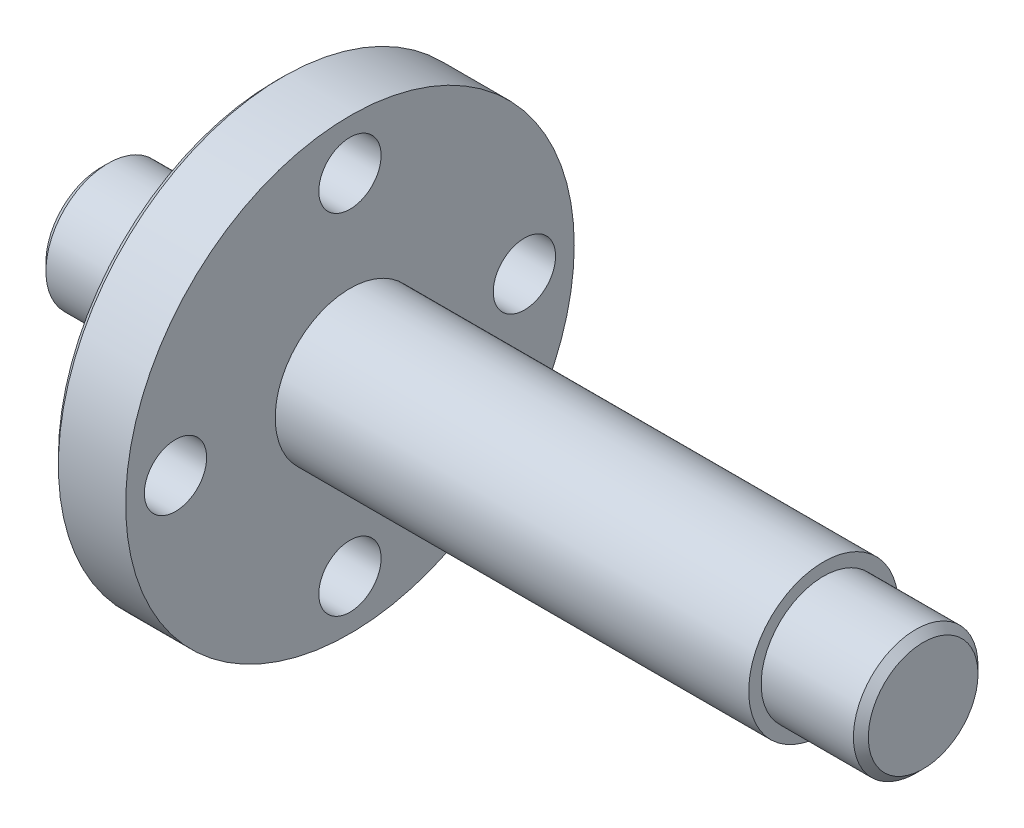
from build123d import *

# Parameters (mm, degrees)
SKETCH_1_R               = 2
EXTRUDE_1_DEPTH          = 15
SKETCH_2_R               = 2.5
EXTRUDE_2_DEPTH          = 4
SKETCH_3_R               = 3
EXTRUDE_3_DEPTH          = 3
SKETCH_4_R               = 9
EXTRUDE_4_DEPTH          = 3
SKETCH_5_R               = 3
EXTRUDE_5_DEPTH          = 19
SKETCH_8_R               = 2.5
EXTRUDE_6_DEPTH          = 4
HOLE_WIZARD_M3_2_D       = 2.5
PATTERN_CIRCULAR_2_COUNT = 4
CHAMFER_1_SIZE           = 0.3
SKETCH_11_W              = 15
SKETCH_11_H              = 4
CUT_EXTRUDE_1_DEPTH      = 5
SKETCH_19_R              = 1.5
CUT_EXTRUDE_3_DEPTH      = 10
CHAMFER_2_SIZE           = 0.3


with BuildPart() as part:
    # Sketch 1 → Extrude 1 (new body)
    with BuildSketch(Plane(origin=(0, 0, 0), x_dir=(0, 0, -1), z_dir=(1, 0, 0))):
        Circle(SKETCH_1_R)
    extrude(amount=EXTRUDE_1_DEPTH)

    # Sketch 2 → Extrude 2 (add)
    with BuildSketch(Plane(origin=(15, 0, 0), x_dir=(0, 0, -1), z_dir=(1, 0, 0))):
        Circle(SKETCH_2_R)
    extrude(amount=EXTRUDE_2_DEPTH)

    # Sketch 3 → Extrude 3 (add)
    with BuildSketch(Plane(origin=(19, 0, 0), x_dir=(0, 0, -1), z_dir=(1, 0, 0))):
        Circle(SKETCH_3_R)
    extrude(amount=EXTRUDE_3_DEPTH)

    # Sketch 4 → Extrude 4 (add)
    with BuildSketch(Plane(origin=(22, 0, 0), x_dir=(0, 0, -1), z_dir=(1, 0, 0))):
        Circle(SKETCH_4_R)
    extrude(amount=EXTRUDE_4_DEPTH)

    # Sketch 5 → Extrude 5 (add)
    with BuildSketch(Plane(origin=(25, 0, 0), x_dir=(0, 0, -1), z_dir=(1, 0, 0))):
        Circle(SKETCH_5_R)
    extrude(amount=EXTRUDE_5_DEPTH)

    # Sketch 8 → Extrude 6 (add)
    with BuildSketch(Plane(origin=(44, 0, 0), x_dir=(0, 0, -1), z_dir=(1, 0, 0))):
        Circle(SKETCH_8_R)
    extrude(amount=EXTRUDE_6_DEPTH)

    # Hole Wizard M3 _2 (through all)
    with Locations(Plane.ZY.offset(-22)):
        with Locations((0, 7)):
            hole_wizard_m3_2 = Hole(HOLE_WIZARD_M3_2_D / 2)

    # Pattern Circular 2: Hole Wizard M3 _2 ×4 about axis
    pattern_circular_2_axis = Axis((0, 0, 0), (1, 0, 0))
    for i in range(1, PATTERN_CIRCULAR_2_COUNT):
        add(hole_wizard_m3_2.rotate(pattern_circular_2_axis, i * 360 / PATTERN_CIRCULAR_2_COUNT), mode=Mode.SUBTRACT)

    # Chamfer 1
    chamfer_1_edges = [part.edges().sort_by_distance(p)[0] for p in [
        (22, 0, 9),
        (0, 0, 2),
        (48, 0, 2.5),
    ]]
    chamfer(chamfer_1_edges, length=CHAMFER_1_SIZE)

    # Sketch 11 → Cut-Extrude 1 (cut, symmetric)
    with BuildSketch(Plane(origin=(0, 0, 0), x_dir=(1, 0, 0), z_dir=(0, 1, 0))):
        with Locations((7.5, 0)):
            Rectangle(SKETCH_11_W, SKETCH_11_H)
    extrude(amount=CUT_EXTRUDE_1_DEPTH, both=True, mode=Mode.SUBTRACT)

    # Sketch 18 → Hole Wizard M2.5 _2 (revolve, cut)
    with BuildSketch(Plane(origin=(20.5, 0, 0), x_dir=(0, -0.7071067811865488, -0.7071067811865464), z_dir=(1, 0, 0))):
        Polygon((0, 0), (0, 3.615882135), (1.025, 3), (1.025, 0), align=None)
    revolve(axis=Axis((20.5, -4.490128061, 4.490128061), (0, 0.7071067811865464, -0.7071067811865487)), mode=Mode.SUBTRACT)

    # Sketch 19 → Cut-Extrude 3 (cut)
    with BuildSketch(Plane.ZY.offset(-15)):
        Circle(SKETCH_19_R)
    extrude(amount=-CUT_EXTRUDE_3_DEPTH, mode=Mode.SUBTRACT)

    # Chamfer 2
    chamfer_2_edges = [part.edges().sort_by_distance(p)[0] for p in [
        (15, 0, 2.5),
    ]]
    chamfer(chamfer_2_edges, length=CHAMFER_2_SIZE)


solid = part.part
